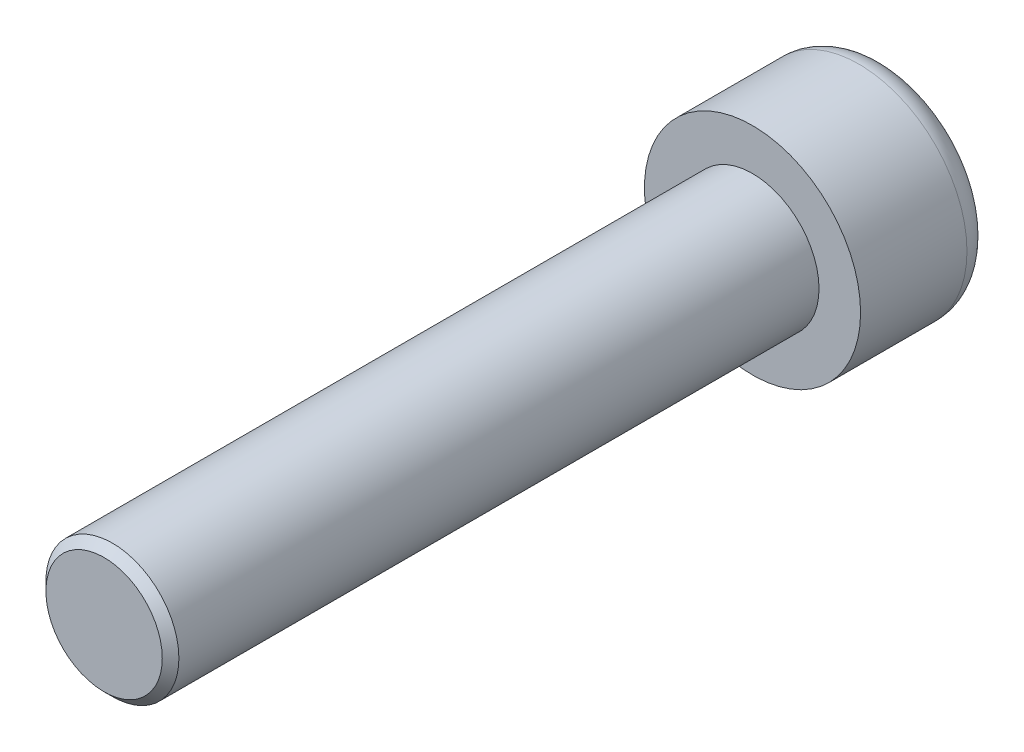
ISO-10303-21;
HEADER;
FILE_DESCRIPTION(('STEP AP214'),'2;1');
FILE_NAME('part.step','',(''),(''),'','','');
FILE_SCHEMA(('AUTOMOTIVE_DESIGN { 1 0 10303 214 1 1 1 1 }'));
ENDSEC;
DATA;
#1=APPLICATION_CONTEXT('core data for automotive mechanical design processes');
#2=APPLICATION_PROTOCOL_DEFINITION('international standard','automotive_design',2000,#1);
#3=PRODUCT_CONTEXT('',#1,'mechanical');
#4=PRODUCT('Part','Part','',(#3));
#5=PRODUCT_RELATED_PRODUCT_CATEGORY('part','',(#4));
#6=PRODUCT_DEFINITION_FORMATION('','',#4);
#7=PRODUCT_DEFINITION_CONTEXT('part definition',#1,'design');
#8=PRODUCT_DEFINITION('design','',#6,#7);
#9=PRODUCT_DEFINITION_SHAPE('','',#8);
#10=(LENGTH_UNIT() NAMED_UNIT(*) SI_UNIT(.MILLI.,.METRE.));
#11=(NAMED_UNIT(*) PLANE_ANGLE_UNIT() SI_UNIT($,.RADIAN.));
#12=(NAMED_UNIT(*) SI_UNIT($,.STERADIAN.) SOLID_ANGLE_UNIT());
#13=UNCERTAINTY_MEASURE_WITH_UNIT(LENGTH_MEASURE(1.E-05),#10,'distance_accuracy_value','');
#14=(GEOMETRIC_REPRESENTATION_CONTEXT(3) GLOBAL_UNCERTAINTY_ASSIGNED_CONTEXT((#13)) GLOBAL_UNIT_ASSIGNED_CONTEXT((#10,
#11,#12)) REPRESENTATION_CONTEXT('',''));
#15=CARTESIAN_POINT('',(0.,0.,0.));
#16=DIRECTION('',(0.,0.,1.));
#17=DIRECTION('',(1.,0.,0.));
#18=AXIS2_PLACEMENT_3D('',#15,#16,#17);
#19=CARTESIAN_POINT('',(0.,0.,48.));
#20=DIRECTION('',(0.,0.,-1.));
#21=DIRECTION('',(-1.,0.,0.));
#22=AXIS2_PLACEMENT_3D('',#19,#20,#21);
#23=CYLINDRICAL_SURFACE('',#22,4.);
#24=CARTESIAN_POINT('',(0.,0.,46.5));
#25=DIRECTION('',(0.,0.,1.));
#26=DIRECTION('',(1.,0.,0.));
#27=AXIS2_PLACEMENT_3D('',#24,#25,#26);
#28=CIRCLE('',#27,4.);
#29=CARTESIAN_POINT('',(4.,0.,46.5));
#30=VERTEX_POINT('',#29);
#31=EDGE_CURVE('E10',#30,#30,#28,.F.);
#32=ORIENTED_EDGE('',*,*,#31,.T.);
#33=EDGE_LOOP('',(#32));
#34=FACE_BOUND('',#33,.T.);
#35=CARTESIAN_POINT('',(0.,0.,8.));
#36=DIRECTION('',(0.,0.,1.));
#37=DIRECTION('',(1.,0.,0.));
#38=AXIS2_PLACEMENT_3D('',#35,#36,#37);
#39=CIRCLE('',#38,4.);
#40=CARTESIAN_POINT('',(4.,0.,8.));
#41=VERTEX_POINT('',#40);
#42=EDGE_CURVE('E117',#41,#41,#39,.T.);
#43=ORIENTED_EDGE('',*,*,#42,.T.);
#44=EDGE_LOOP('',(#43));
#45=FACE_BOUND('',#44,.T.);
#46=ADVANCED_FACE('F15',(#34,#45),#23,.T.);
#47=CARTESIAN_POINT('',(0.,0.,8.));
#48=DIRECTION('',(0.,0.,1.));
#49=DIRECTION('',(1.,0.,0.));
#50=AXIS2_PLACEMENT_3D('',#47,#48,#49);
#51=PLANE('',#50);
#52=CARTESIAN_POINT('',(0.,0.,8.));
#53=DIRECTION('',(0.,0.,1.));
#54=DIRECTION('',(1.,0.,0.));
#55=AXIS2_PLACEMENT_3D('',#52,#53,#54);
#56=CIRCLE('',#55,6.5);
#57=CARTESIAN_POINT('',(6.5,0.,8.));
#58=VERTEX_POINT('',#57);
#59=EDGE_CURVE('E125',#58,#58,#56,.T.);
#60=ORIENTED_EDGE('',*,*,#59,.T.);
#61=EDGE_LOOP('',(#60));
#62=FACE_BOUND('',#61,.T.);
#63=ORIENTED_EDGE('',*,*,#42,.F.);
#64=EDGE_LOOP('',(#63));
#65=FACE_BOUND('',#64,.T.);
#66=ADVANCED_FACE('F153',(#62,#65),#51,.T.);
#67=CARTESIAN_POINT('',(0.,0.,8.));
#68=DIRECTION('',(0.,0.,-1.));
#69=DIRECTION('',(-1.,0.,0.));
#70=AXIS2_PLACEMENT_3D('',#67,#68,#69);
#71=CYLINDRICAL_SURFACE('',#70,6.5);
#72=CARTESIAN_POINT('',(0.,0.,1.6));
#73=DIRECTION('',(0.,0.,1.));
#74=DIRECTION('',(1.,0.,0.));
#75=AXIS2_PLACEMENT_3D('',#72,#73,#74);
#76=CIRCLE('',#75,6.5);
#77=CARTESIAN_POINT('',(6.5,0.,1.6));
#78=VERTEX_POINT('',#77);
#79=EDGE_CURVE('E128',#78,#78,#76,.T.);
#80=ORIENTED_EDGE('',*,*,#79,.T.);
#81=EDGE_LOOP('',(#80));
#82=FACE_BOUND('',#81,.T.);
#83=ORIENTED_EDGE('',*,*,#59,.F.);
#84=EDGE_LOOP('',(#83));
#85=FACE_BOUND('',#84,.T.);
#86=ADVANCED_FACE('F160',(#82,#85),#71,.T.);
#87=CARTESIAN_POINT('',(0.,0.,0.));
#88=DIRECTION('',(0.,0.,1.));
#89=DIRECTION('',(1.,0.,0.));
#90=AXIS2_PLACEMENT_3D('',#87,#88,#89);
#91=PLANE('',#90);
#92=DIRECTION('',(0.866025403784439,-0.5,0.));
#93=VECTOR('',#92,1.);
#94=CARTESIAN_POINT('',(0.,3.46410161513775,0.));
#95=LINE('',#94,#93);
#96=CARTESIAN_POINT('',(0.,3.46410161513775,0.));
#97=VERTEX_POINT('',#96);
#98=CARTESIAN_POINT('',(3.,1.73205080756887,0.));
#99=VERTEX_POINT('',#98);
#100=EDGE_CURVE('E104',#97,#99,#95,.T.);
#101=ORIENTED_EDGE('',*,*,#100,.F.);
#102=DIRECTION('',(0.866025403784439,0.5,0.));
#103=VECTOR('',#102,1.);
#104=CARTESIAN_POINT('',(-3.,1.73205080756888,0.));
#105=LINE('',#104,#103);
#106=CARTESIAN_POINT('',(-3.,1.73205080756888,0.));
#107=VERTEX_POINT('',#106);
#108=EDGE_CURVE('E30',#107,#97,#105,.T.);
#109=ORIENTED_EDGE('',*,*,#108,.F.);
#110=DIRECTION('',(0.,1.,0.));
#111=VECTOR('',#110,1.);
#112=CARTESIAN_POINT('',(-3.,-1.73205080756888,0.));
#113=LINE('',#112,#111);
#114=CARTESIAN_POINT('',(-3.,-1.73205080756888,0.));
#115=VERTEX_POINT('',#114);
#116=EDGE_CURVE('E113',#115,#107,#113,.T.);
#117=ORIENTED_EDGE('',*,*,#116,.F.);
#118=DIRECTION('',(-0.866025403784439,0.5,0.));
#119=VECTOR('',#118,1.);
#120=CARTESIAN_POINT('',(0.,-3.46410161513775,0.));
#121=LINE('',#120,#119);
#122=CARTESIAN_POINT('',(0.,-3.46410161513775,0.));
#123=VERTEX_POINT('',#122);
#124=EDGE_CURVE('E111',#123,#115,#121,.T.);
#125=ORIENTED_EDGE('',*,*,#124,.F.);
#126=DIRECTION('',(-0.866025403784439,-0.5,0.));
#127=VECTOR('',#126,1.);
#128=CARTESIAN_POINT('',(3.,-1.73205080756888,0.));
#129=LINE('',#128,#127);
#130=CARTESIAN_POINT('',(3.,-1.73205080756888,0.));
#131=VERTEX_POINT('',#130);
#132=EDGE_CURVE('E78',#131,#123,#129,.T.);
#133=ORIENTED_EDGE('',*,*,#132,.F.);
#134=DIRECTION('',(0.,-1.,0.));
#135=VECTOR('',#134,1.);
#136=CARTESIAN_POINT('',(3.,1.73205080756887,0.));
#137=LINE('',#136,#135);
#138=EDGE_CURVE('E107',#99,#131,#137,.T.);
#139=ORIENTED_EDGE('',*,*,#138,.F.);
#140=EDGE_LOOP('',(#101,#109,#117,#125,#133,#139));
#141=FACE_BOUND('',#140,.T.);
#142=CARTESIAN_POINT('',(0.,0.,0.));
#143=DIRECTION('',(0.,0.,1.));
#144=DIRECTION('',(1.,0.,0.));
#145=AXIS2_PLACEMENT_3D('',#142,#143,#144);
#146=CIRCLE('',#145,4.9);
#147=CARTESIAN_POINT('',(4.9,0.,0.));
#148=VERTEX_POINT('',#147);
#149=EDGE_CURVE('E131',#148,#148,#146,.F.);
#150=ORIENTED_EDGE('',*,*,#149,.T.);
#151=EDGE_LOOP('',(#150));
#152=FACE_BOUND('',#151,.T.);
#153=ADVANCED_FACE('F165',(#141,#152),#91,.F.);
#154=CARTESIAN_POINT('',(0.,0.,1.6));
#155=DIRECTION('',(0.,0.,1.));
#156=DIRECTION('',(1.,0.,0.));
#157=AXIS2_PLACEMENT_3D('',#154,#155,#156);
#158=TOROIDAL_SURFACE('',#157,4.9,1.6);
#159=ORIENTED_EDGE('',*,*,#149,.F.);
#160=EDGE_LOOP('',(#159));
#161=FACE_BOUND('',#160,.T.);
#162=ORIENTED_EDGE('',*,*,#79,.F.);
#163=EDGE_LOOP('',(#162));
#164=FACE_BOUND('',#163,.T.);
#165=ADVANCED_FACE('F149',(#161,#164),#158,.T.);
#166=CARTESIAN_POINT('',(0.,0.,47.));
#167=DIRECTION('',(0.,0.,1.));
#168=DIRECTION('',(1.,0.,0.));
#169=AXIS2_PLACEMENT_3D('',#166,#167,#168);
#170=PLANE('',#169);
#171=CARTESIAN_POINT('',(0.,0.,47.));
#172=DIRECTION('',(0.,0.,1.));
#173=DIRECTION('',(1.,0.,0.));
#174=AXIS2_PLACEMENT_3D('',#171,#172,#173);
#175=CIRCLE('',#174,3.5);
#176=CARTESIAN_POINT('',(3.5,0.,47.));
#177=VERTEX_POINT('',#176);
#178=EDGE_CURVE('E23',#177,#177,#175,.T.);
#179=ORIENTED_EDGE('',*,*,#178,.T.);
#180=EDGE_LOOP('',(#179));
#181=FACE_BOUND('',#180,.T.);
#182=ADVANCED_FACE('F136',(#181),#170,.T.);
#183=CARTESIAN_POINT('',(0.,0.,47.));
#184=DIRECTION('',(0.,0.,-1.));
#185=DIRECTION('',(-1.,0.,0.));
#186=AXIS2_PLACEMENT_3D('',#183,#184,#185);
#187=CONICAL_SURFACE('',#186,3.5,0.785398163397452);
#188=ORIENTED_EDGE('',*,*,#31,.F.);
#189=EDGE_LOOP('',(#188));
#190=FACE_BOUND('',#189,.T.);
#191=ORIENTED_EDGE('',*,*,#178,.F.);
#192=EDGE_LOOP('',(#191));
#193=FACE_BOUND('',#192,.T.);
#194=ADVANCED_FACE('F17',(#190,#193),#187,.T.);
#195=CARTESIAN_POINT('',(-3.,1.73205080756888,4.));
#196=DIRECTION('',(-0.5,0.866025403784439,0.));
#197=DIRECTION('',(-0.866025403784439,-0.5,0.));
#198=AXIS2_PLACEMENT_3D('',#195,#196,#197);
#199=PLANE('',#198);
#200=ORIENTED_EDGE('',*,*,#108,.T.);
#201=DIRECTION('',(0.,0.,-1.));
#202=VECTOR('',#201,1.);
#203=CARTESIAN_POINT('',(0.,3.46410161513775,4.));
#204=LINE('',#203,#202);
#205=CARTESIAN_POINT('',(0.,3.46410161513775,4.));
#206=VERTEX_POINT('',#205);
#207=EDGE_CURVE('E60',#206,#97,#204,.T.);
#208=ORIENTED_EDGE('',*,*,#207,.F.);
#209=DIRECTION('',(0.866025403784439,0.5,0.));
#210=VECTOR('',#209,1.);
#211=CARTESIAN_POINT('',(-3.,1.73205080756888,4.));
#212=LINE('',#211,#210);
#213=CARTESIAN_POINT('',(-3.,1.73205080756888,4.));
#214=VERTEX_POINT('',#213);
#215=EDGE_CURVE('E115',#214,#206,#212,.T.);
#216=ORIENTED_EDGE('',*,*,#215,.F.);
#217=DIRECTION('',(0.,0.,-1.));
#218=VECTOR('',#217,1.);
#219=CARTESIAN_POINT('',(-3.,1.73205080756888,4.));
#220=LINE('',#219,#218);
#221=EDGE_CURVE('E38',#214,#107,#220,.T.);
#222=ORIENTED_EDGE('',*,*,#221,.T.);
#223=EDGE_LOOP('',(#200,#208,#216,#222));
#224=FACE_BOUND('',#223,.T.);
#225=ADVANCED_FACE('F139',(#224),#199,.F.);
#226=CARTESIAN_POINT('',(-3.,-1.73205080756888,4.));
#227=DIRECTION('',(-1.,0.,0.));
#228=DIRECTION('',(0.,0.,1.));
#229=AXIS2_PLACEMENT_3D('',#226,#227,#228);
#230=PLANE('',#229);
#231=ORIENTED_EDGE('',*,*,#116,.T.);
#232=ORIENTED_EDGE('',*,*,#221,.F.);
#233=DIRECTION('',(0.,1.,0.));
#234=VECTOR('',#233,1.);
#235=CARTESIAN_POINT('',(-3.,-1.73205080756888,4.));
#236=LINE('',#235,#234);
#237=CARTESIAN_POINT('',(-3.,-1.73205080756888,4.));
#238=VERTEX_POINT('',#237);
#239=EDGE_CURVE('E90',#238,#214,#236,.T.);
#240=ORIENTED_EDGE('',*,*,#239,.F.);
#241=DIRECTION('',(0.,0.,-1.));
#242=VECTOR('',#241,1.);
#243=CARTESIAN_POINT('',(-3.,-1.73205080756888,4.));
#244=LINE('',#243,#242);
#245=EDGE_CURVE('E82',#238,#115,#244,.T.);
#246=ORIENTED_EDGE('',*,*,#245,.T.);
#247=EDGE_LOOP('',(#231,#232,#240,#246));
#248=FACE_BOUND('',#247,.T.);
#249=ADVANCED_FACE('F147',(#248),#230,.F.);
#250=CARTESIAN_POINT('',(0.,-3.46410161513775,4.));
#251=DIRECTION('',(-0.5,-0.866025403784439,0.));
#252=DIRECTION('',(0.866025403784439,-0.5,0.));
#253=AXIS2_PLACEMENT_3D('',#250,#251,#252);
#254=PLANE('',#253);
#255=ORIENTED_EDGE('',*,*,#124,.T.);
#256=ORIENTED_EDGE('',*,*,#245,.F.);
#257=DIRECTION('',(-0.866025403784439,0.5,0.));
#258=VECTOR('',#257,1.);
#259=CARTESIAN_POINT('',(0.,-3.46410161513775,4.));
#260=LINE('',#259,#258);
#261=CARTESIAN_POINT('',(0.,-3.46410161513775,4.));
#262=VERTEX_POINT('',#261);
#263=EDGE_CURVE('E86',#262,#238,#260,.T.);
#264=ORIENTED_EDGE('',*,*,#263,.F.);
#265=DIRECTION('',(0.,0.,-1.));
#266=VECTOR('',#265,1.);
#267=CARTESIAN_POINT('',(0.,-3.46410161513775,4.));
#268=LINE('',#267,#266);
#269=EDGE_CURVE('E71',#262,#123,#268,.T.);
#270=ORIENTED_EDGE('',*,*,#269,.T.);
#271=EDGE_LOOP('',(#255,#256,#264,#270));
#272=FACE_BOUND('',#271,.T.);
#273=ADVANCED_FACE('F87',(#272),#254,.F.);
#274=CARTESIAN_POINT('',(3.,-1.73205080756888,4.));
#275=DIRECTION('',(0.5,-0.866025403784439,0.));
#276=DIRECTION('',(0.866025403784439,0.5,0.));
#277=AXIS2_PLACEMENT_3D('',#274,#275,#276);
#278=PLANE('',#277);
#279=ORIENTED_EDGE('',*,*,#132,.T.);
#280=ORIENTED_EDGE('',*,*,#269,.F.);
#281=DIRECTION('',(-0.866025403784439,-0.5,0.));
#282=VECTOR('',#281,1.);
#283=CARTESIAN_POINT('',(3.,-1.73205080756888,4.));
#284=LINE('',#283,#282);
#285=CARTESIAN_POINT('',(3.,-1.73205080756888,4.));
#286=VERTEX_POINT('',#285);
#287=EDGE_CURVE('E75',#286,#262,#284,.T.);
#288=ORIENTED_EDGE('',*,*,#287,.F.);
#289=DIRECTION('',(0.,0.,-1.));
#290=VECTOR('',#289,1.);
#291=CARTESIAN_POINT('',(3.,-1.73205080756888,4.));
#292=LINE('',#291,#290);
#293=EDGE_CURVE('E83',#286,#131,#292,.T.);
#294=ORIENTED_EDGE('',*,*,#293,.T.);
#295=EDGE_LOOP('',(#279,#280,#288,#294));
#296=FACE_BOUND('',#295,.T.);
#297=ADVANCED_FACE('F73',(#296),#278,.F.);
#298=CARTESIAN_POINT('',(3.,1.73205080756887,4.));
#299=DIRECTION('',(1.,0.,0.));
#300=DIRECTION('',(0.,0.,-1.));
#301=AXIS2_PLACEMENT_3D('',#298,#299,#300);
#302=PLANE('',#301);
#303=ORIENTED_EDGE('',*,*,#138,.T.);
#304=ORIENTED_EDGE('',*,*,#293,.F.);
#305=DIRECTION('',(0.,-1.,0.));
#306=VECTOR('',#305,1.);
#307=CARTESIAN_POINT('',(3.,1.73205080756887,4.));
#308=LINE('',#307,#306);
#309=CARTESIAN_POINT('',(3.,1.73205080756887,4.));
#310=VERTEX_POINT('',#309);
#311=EDGE_CURVE('E96',#310,#286,#308,.T.);
#312=ORIENTED_EDGE('',*,*,#311,.F.);
#313=DIRECTION('',(0.,0.,-1.));
#314=VECTOR('',#313,1.);
#315=CARTESIAN_POINT('',(3.,1.73205080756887,4.));
#316=LINE('',#315,#314);
#317=EDGE_CURVE('E120',#310,#99,#316,.T.);
#318=ORIENTED_EDGE('',*,*,#317,.T.);
#319=EDGE_LOOP('',(#303,#304,#312,#318));
#320=FACE_BOUND('',#319,.T.);
#321=ADVANCED_FACE('F229',(#320),#302,.F.);
#322=CARTESIAN_POINT('',(0.,3.46410161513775,4.));
#323=DIRECTION('',(0.5,0.866025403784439,0.));
#324=DIRECTION('',(-0.866025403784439,0.5,0.));
#325=AXIS2_PLACEMENT_3D('',#322,#323,#324);
#326=PLANE('',#325);
#327=ORIENTED_EDGE('',*,*,#100,.T.);
#328=ORIENTED_EDGE('',*,*,#317,.F.);
#329=DIRECTION('',(0.866025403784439,-0.5,0.));
#330=VECTOR('',#329,1.);
#331=CARTESIAN_POINT('',(0.,3.46410161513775,4.));
#332=LINE('',#331,#330);
#333=EDGE_CURVE('E98',#206,#310,#332,.T.);
#334=ORIENTED_EDGE('',*,*,#333,.F.);
#335=ORIENTED_EDGE('',*,*,#207,.T.);
#336=EDGE_LOOP('',(#327,#328,#334,#335));
#337=FACE_BOUND('',#336,.T.);
#338=ADVANCED_FACE('F236',(#337),#326,.F.);
#339=CARTESIAN_POINT('',(0.,3.46410161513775,4.));
#340=DIRECTION('',(0.,0.,-1.));
#341=DIRECTION('',(-1.,0.,0.));
#342=AXIS2_PLACEMENT_3D('',#339,#340,#341);
#343=PLANE('',#342);
#344=ORIENTED_EDGE('',*,*,#215,.T.);
#345=ORIENTED_EDGE('',*,*,#333,.T.);
#346=ORIENTED_EDGE('',*,*,#311,.T.);
#347=ORIENTED_EDGE('',*,*,#287,.T.);
#348=ORIENTED_EDGE('',*,*,#263,.T.);
#349=ORIENTED_EDGE('',*,*,#239,.T.);
#350=EDGE_LOOP('',(#344,#345,#346,#347,#348,#349));
#351=FACE_BOUND('',#350,.T.);
#352=ADVANCED_FACE('F93',(#351),#343,.T.);
#353=CLOSED_SHELL('',(#46,#66,#86,#153,#165,#182,#194,#225,#249,#273,#297,#321,#338,#352));
#354=MANIFOLD_SOLID_BREP('B1',#353);
#355=ADVANCED_BREP_SHAPE_REPRESENTATION('',(#18,#354),#14);
#356=SHAPE_DEFINITION_REPRESENTATION(#9,#355);
ENDSEC;
END-ISO-10303-21;
